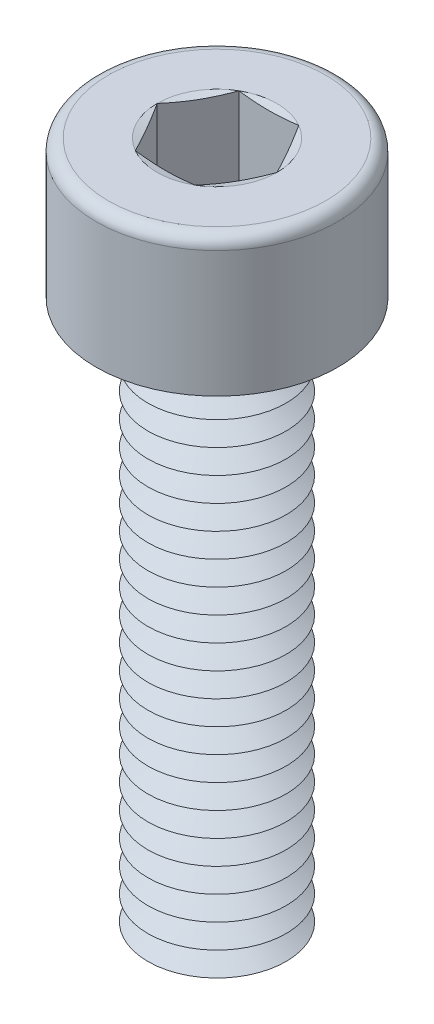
from build123d import *

# Parameters (mm, degrees)
SKETCH1_R       = 2
EXTRUDE1_DEPTH  = 16
SKETCH2_R       = 3.5
EXTRUDE2_DEPTH  = 4
EXTRUDE3_DEPTH  = 3
FILLET1_R       = 0.35
LPATTERN1_COUNT = 23
LPATTERN1_PITCH = 0.7


with BuildPart() as part:
    # Sketch1 → Extrude1 (new body)
    with BuildSketch(Plane(origin=(0, 0, 0), x_dir=(1, 0, 0), z_dir=(0, 1, 0))):
        with Locations(Location((0, 0, 0), (0, 0, 270))):
            Circle(SKETCH1_R)
    extrude(amount=EXTRUDE1_DEPTH)

    # Sketch2 → Extrude2 (add)
    with BuildSketch(Plane(origin=(0, 16, 0), x_dir=(1, 0, 0), z_dir=(0, 1, 0))):
        with Locations(Location((0, 0, 0), (0, 0, 270))):
            Circle(SKETCH2_R)
    extrude(amount=EXTRUDE2_DEPTH)

    # Sketch3 → Extrude3 (cut)
    with BuildSketch(Plane(origin=(0, 20, 0), x_dir=(1, 0, 0), z_dir=(0, 1, 0))):
        Polygon((0.866025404, 1.5), (-0.866025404, 1.5), (-1.732050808, 0), (-0.866025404, -1.5), (0.866025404, -1.5), (1.732050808, 0), align=None)
    extrude(amount=-EXTRUDE3_DEPTH, mode=Mode.SUBTRACT)

    # Fillet1
    fillet1_edges = [part.edges().sort_by_distance(p)[0] for p in [
        (0, 20, -3.5),
    ]]
    fillet(fillet1_edges, radius=FILLET1_R)

    # Sketch4 → Cut-Revolve1 (revolve, cut)
    with BuildSketch(Plane(origin=(0, 0, 0), x_dir=(0, 0, -1), z_dir=(1, 0, 0))):
        Polygon((-1.5, 17), (0, 17), (0, 16.133974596), align=None)
    revolve(axis=Axis((0, 17, 0), (0, -1, 0)), mode=Mode.SUBTRACT)

    # Sketch5 → Cut-Revolve2 (revolve, cut)
    with BuildSketch(Plane.XY, mode=Mode.PRIVATE) as cut_revolve2_sk:
        Polygon((-2, 0.35), (-2, -0.35), (-1.393782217, 0), align=None)
    cut_revolve2 = revolve(cut_revolve2_sk.sketch.rotate(Axis((0, 16, 0), (0, -1, 0)), 270), axis=Axis((0, 16, 0), (0, -1, 0)), mode=Mode.SUBTRACT)

    # LPattern1: Cut-Revolve2 ×23
    with Locations(*[(0, i * LPATTERN1_PITCH, 0) for i in range(1, LPATTERN1_COUNT)]):
        add(cut_revolve2, mode=Mode.SUBTRACT)

    # Extrude4 cone 1 section (on through the dimple's axis) → Extrude4 (revolve, cut)
    with BuildSketch(Plane(origin=(0, 20, 0), x_dir=(0, 0, 1), z_dir=(1, 0, 0))):
        Polygon((0, 0), (1.732050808, 0), (0, 0.464101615), align=None)
    revolve(axis=Axis((0, 20, 0), (0, -1, 0)), mode=Mode.SUBTRACT)


solid = part.part
